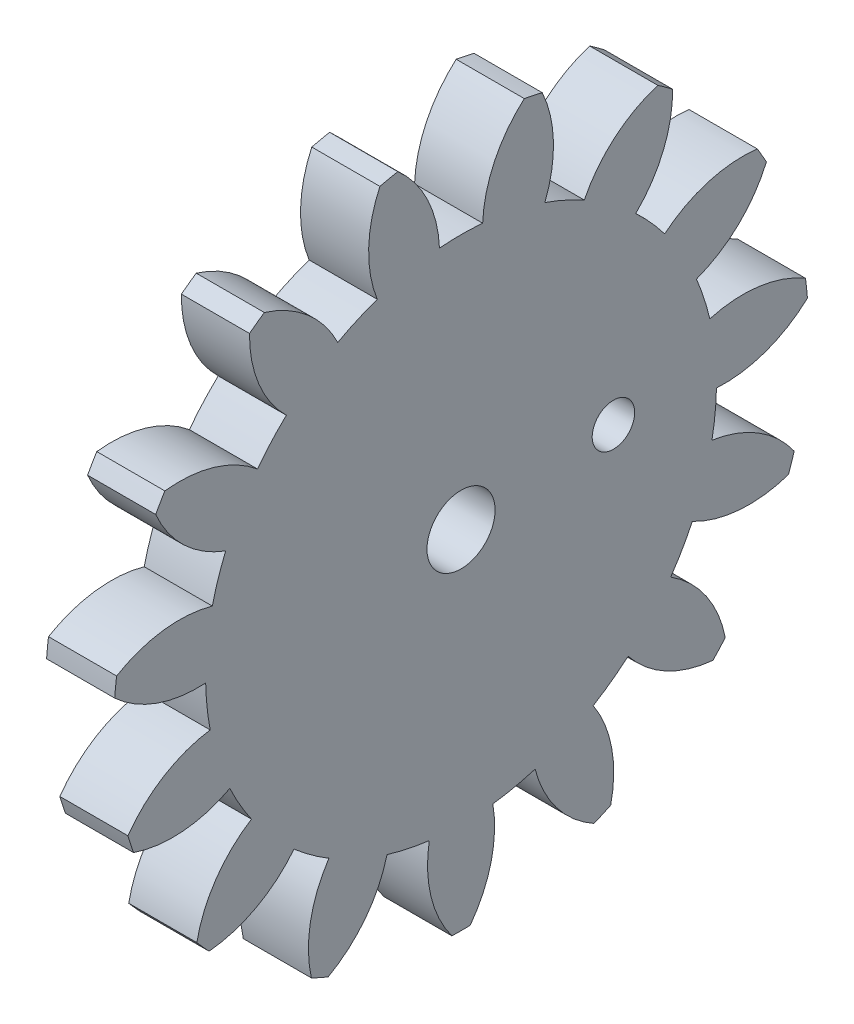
from build123d import *

# Parameters (mm, degrees)
BASPROSKE_W             = 5
BASPROSKE_H             = 25.5
TOOTHCUT_DEPTH          = 37.407416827
TEETHCUTS_COUNT         = 15
BORSKE_R                = 2.5
BORE_DEPTH              = 50.0000508
ESQUISSE1_R             = 1.558854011
ENL_V_MAT_EXTRU_1_DEPTH = 10


with BuildPart() as part:
    # BasProSke → Base-Revolve (revolve)
    with BuildSketch(Plane(origin=(0, 0, 0), x_dir=(1, 0, 0), z_dir=(0, 1, 0)), mode=Mode.PRIVATE) as base_revolve_sk:
        with Locations((2.5, 12.75)):
            Rectangle(BASPROSKE_W, BASPROSKE_H)
    revolve(base_revolve_sk.sketch.rotate(Axis((-10, 0, 0), (1, 0, 0)), 180), axis=Axis((-10, 0, 0), (1, 0, 0)))

    # TooCutSke → ToothCut (cut, through all)
    with BuildSketch(Plane(origin=(0, 0, 0), x_dir=(0, 0, -1), z_dir=(1, 0, 0))):
        with BuildLine():
            ThreePointArc((1.584594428, 18.681918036), (0, 18.749), (-1.584594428, 18.681918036))
            ThreePointArc((-1.584594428, 18.681918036), (-2.465052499, 22.206073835), (-4.666912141, 25.095138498))
            ThreePointArc((-4.666912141, 25.095138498), (0, 25.5254), (4.666912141, 25.095138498))
            ThreePointArc((4.666912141, 25.095138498), (2.465052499, 22.206073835), (1.584594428, 18.681918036))
        make_face()
    toothcut = extrude(amount=TOOTHCUT_DEPTH, mode=Mode.SUBTRACT)

    # TeethCuts: ToothCut ×15 about axis
    teethcuts_axis = Axis((0, 0, 0), (1, 0, 0))
    for i in range(1, TEETHCUTS_COUNT):
        add(toothcut.rotate(teethcuts_axis, i * 360 / TEETHCUTS_COUNT), mode=Mode.SUBTRACT)

    # BorSke → Bore (cut, symmetric)
    with BuildSketch(Plane(origin=(0, 0, 0), x_dir=(0, 0, -1), z_dir=(1, 0, 0))):
        with Locations(Location((0, 0, 0), (0, 0, 180))):
            Circle(BORSKE_R)
    extrude(amount=BORE_DEPTH, both=True, mode=Mode.SUBTRACT)

    # Esquisse1 → Enl_v. mat.-Extru.1 (cut)
    with BuildSketch(Plane(origin=(5, 0, 0), x_dir=(0, 0, -1), z_dir=(1, 0, 0))):
        with Locations((11.184777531, 1.072969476)):
            Circle(ESQUISSE1_R)
    extrude(amount=-ENL_V_MAT_EXTRU_1_DEPTH, mode=Mode.SUBTRACT)


solid = part.part
